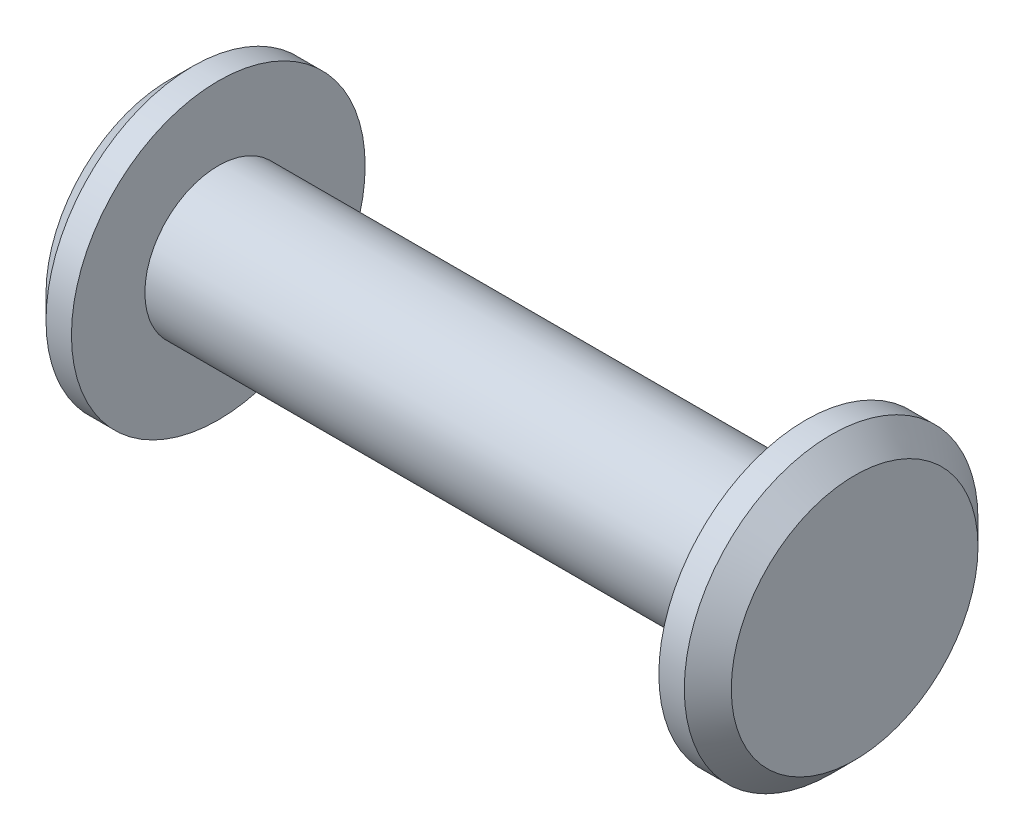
from build123d import *

# Parameters (mm, degrees)
CHAMFER1_SIZE = 0.762


with BuildPart() as part:
    # Sketch1 → Base-Revolve (revolve)
    with BuildSketch(Plane.XY, mode=Mode.PRIVATE) as base_revolve_sk:
        Polygon((11.1125, 0), (11.1125, 4.7625), (9.525, 4.7625), (9.525, 2.38125), (-9.525, 2.38125), (-9.525, 4.7625), (-11.1125, 4.7625), (-11.1125, 0), align=None)
    revolve(base_revolve_sk.sketch.rotate(Axis((0, 0, 0), (1, 0, 0)), 90), axis=Axis((0, 0, 0), (1, 0, 0)))

    # Chamfer1
    chamfer1_edges = [part.edges().sort_by_distance(p)[0] for p in [
        (11.1125, 0, -4.7625),
        (-11.1125, 0, -4.7625),
    ]]
    chamfer(chamfer1_edges, length=CHAMFER1_SIZE)


solid = part.part
